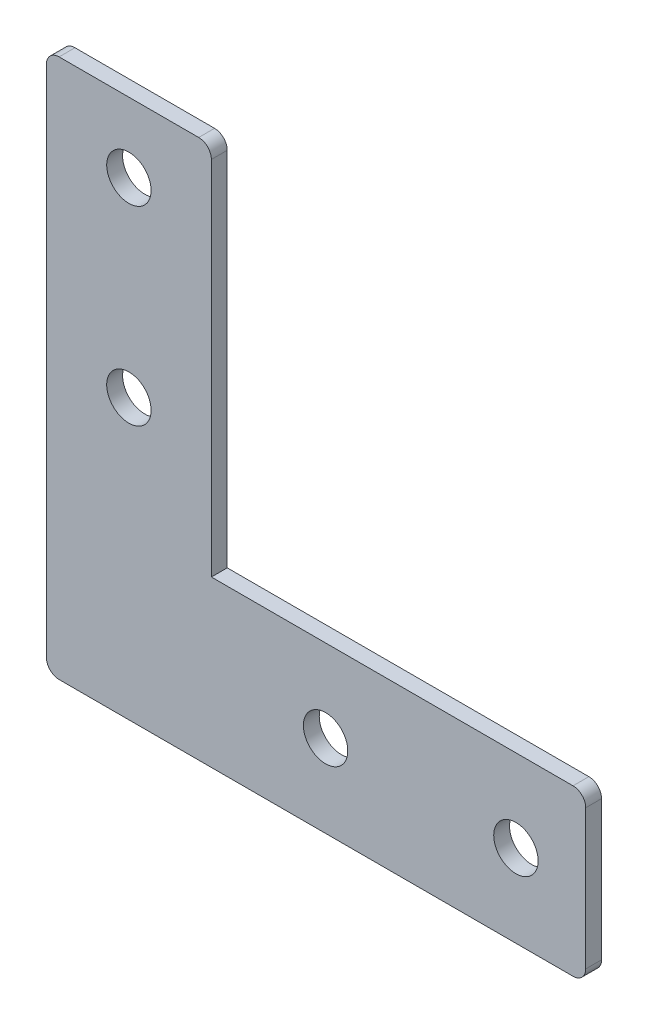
from build123d import *

# Parameters (mm, degrees)
SKETCH_1_R      = 3.5
EXTRUDE_1_DEPTH = 1.25
FILLET_1_R      = 2


with BuildPart() as part:
    # Sketch 1 → Extrude 1 (new, symmetric)
    with BuildSketch(Plane.XY):
        Polygon((0, 0), (85, 0), (85, 26), (26, 26), (26, 85), (0, 85), align=None)
        with Locations((13, 74)):
            Circle(SKETCH_1_R, mode=Mode.SUBTRACT)
        with Locations((13, 44)):
            Circle(SKETCH_1_R, mode=Mode.SUBTRACT)
        with Locations(Location((44, 13, 0), (0, 0, 180))):
            Circle(SKETCH_1_R, mode=Mode.SUBTRACT)
        with Locations(Location((74, 13, 0), (0, 0, 180))):
            Circle(SKETCH_1_R, mode=Mode.SUBTRACT)
    extrude(amount=EXTRUDE_1_DEPTH, both=True)

    # Fillet 1
    fillet_1_edges = [part.edges().sort_by_distance(p)[0] for p in [
        (0, 85, 0),
        (26, 85, 0),
        (85, 26, 0),
        (85, 0, 0),
        (0, 0, 0),
    ]]
    fillet(fillet_1_edges, radius=FILLET_1_R)


solid = part.part
